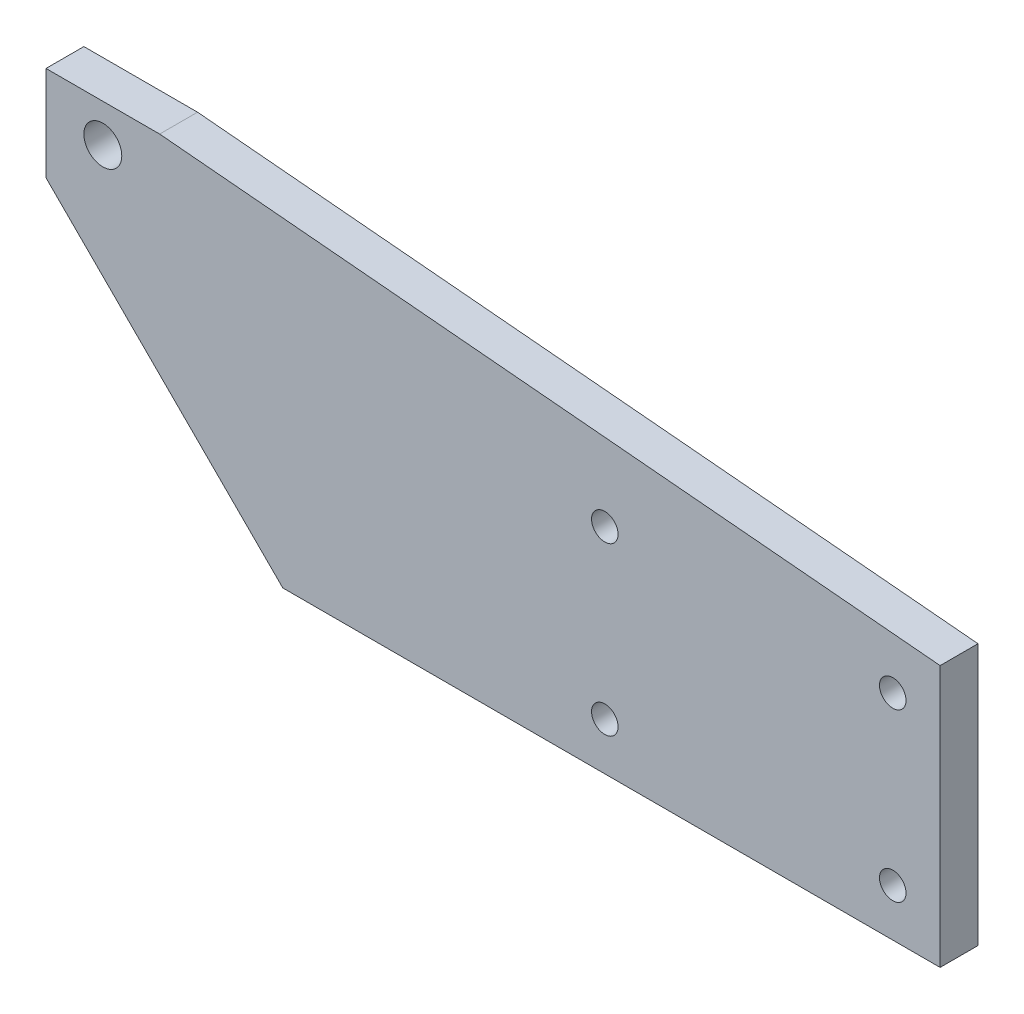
ISO-10303-21;
HEADER;
FILE_DESCRIPTION(('STEP AP214'),'2;1');
FILE_NAME('part.step','',(''),(''),'','','');
FILE_SCHEMA(('AUTOMOTIVE_DESIGN { 1 0 10303 214 1 1 1 1 }'));
ENDSEC;
DATA;
#1=APPLICATION_CONTEXT('core data for automotive mechanical design processes');
#2=APPLICATION_PROTOCOL_DEFINITION('international standard','automotive_design',2000,#1);
#3=PRODUCT_CONTEXT('',#1,'mechanical');
#4=PRODUCT('Part','Part','',(#3));
#5=PRODUCT_RELATED_PRODUCT_CATEGORY('part','',(#4));
#6=PRODUCT_DEFINITION_FORMATION('','',#4);
#7=PRODUCT_DEFINITION_CONTEXT('part definition',#1,'design');
#8=PRODUCT_DEFINITION('design','',#6,#7);
#9=PRODUCT_DEFINITION_SHAPE('','',#8);
#10=(LENGTH_UNIT() NAMED_UNIT(*) SI_UNIT(.MILLI.,.METRE.));
#11=(NAMED_UNIT(*) PLANE_ANGLE_UNIT() SI_UNIT($,.RADIAN.));
#12=(NAMED_UNIT(*) SI_UNIT($,.STERADIAN.) SOLID_ANGLE_UNIT());
#13=UNCERTAINTY_MEASURE_WITH_UNIT(LENGTH_MEASURE(1.E-05),#10,'distance_accuracy_value','');
#14=(GEOMETRIC_REPRESENTATION_CONTEXT(3) GLOBAL_UNCERTAINTY_ASSIGNED_CONTEXT((#13)) GLOBAL_UNIT_ASSIGNED_CONTEXT((#10,
#11,#12)) REPRESENTATION_CONTEXT('',''));
#15=CARTESIAN_POINT('',(0.,0.,0.));
#16=DIRECTION('',(0.,0.,1.));
#17=DIRECTION('',(1.,0.,0.));
#18=AXIS2_PLACEMENT_3D('',#15,#16,#17);
#19=CARTESIAN_POINT('',(472.,175.,0.));
#20=DIRECTION('',(0.,0.,1.));
#21=DIRECTION('',(1.,0.,0.));
#22=AXIS2_PLACEMENT_3D('',#19,#20,#21);
#23=PLANE('',#22);
#24=CARTESIAN_POINT('',(295.,25.,0.));
#25=DIRECTION('',(0.,0.,1.));
#26=DIRECTION('',(1.,0.,0.));
#27=AXIS2_PLACEMENT_3D('',#24,#25,#26);
#28=CIRCLE('',#27,6.99999999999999);
#29=CARTESIAN_POINT('',(302.,25.,0.));
#30=VERTEX_POINT('',#29);
#31=EDGE_CURVE('E195',#30,#30,#28,.T.);
#32=ORIENTED_EDGE('',*,*,#31,.T.);
#33=EDGE_LOOP('',(#32));
#34=FACE_BOUND('',#33,.T.);
#35=CARTESIAN_POINT('',(447.,25.,0.));
#36=DIRECTION('',(0.,0.,1.));
#37=DIRECTION('',(1.,0.,0.));
#38=AXIS2_PLACEMENT_3D('',#35,#36,#37);
#39=CIRCLE('',#38,6.99999999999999);
#40=CARTESIAN_POINT('',(454.,25.,0.));
#41=VERTEX_POINT('',#40);
#42=EDGE_CURVE('E208',#41,#41,#39,.T.);
#43=ORIENTED_EDGE('',*,*,#42,.T.);
#44=EDGE_LOOP('',(#43));
#45=FACE_BOUND('',#44,.T.);
#46=DIRECTION('',(-1.,0.,0.));
#47=VECTOR('',#46,1.);
#48=CARTESIAN_POINT('',(0.,175.,0.));
#49=LINE('',#48,#47);
#50=CARTESIAN_POINT('',(60.,175.,0.));
#51=VERTEX_POINT('',#50);
#52=CARTESIAN_POINT('',(0.,175.,0.));
#53=VERTEX_POINT('',#52);
#54=EDGE_CURVE('E87',#51,#53,#49,.T.);
#55=ORIENTED_EDGE('',*,*,#54,.F.);
#56=DIRECTION('',(-0.995991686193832,0.0894458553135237,0.));
#57=VECTOR('',#56,1.);
#58=CARTESIAN_POINT('',(472.,138.,0.));
#59=LINE('',#58,#57);
#60=CARTESIAN_POINT('',(472.,138.,0.));
#61=VERTEX_POINT('',#60);
#62=EDGE_CURVE('E113',#61,#51,#59,.T.);
#63=ORIENTED_EDGE('',*,*,#62,.F.);
#64=DIRECTION('',(0.,1.,0.));
#65=VECTOR('',#64,1.);
#66=CARTESIAN_POINT('',(472.,0.,0.));
#67=LINE('',#66,#65);
#68=CARTESIAN_POINT('',(472.,0.,0.));
#69=VERTEX_POINT('',#68);
#70=EDGE_CURVE('E111',#69,#61,#67,.T.);
#71=ORIENTED_EDGE('',*,*,#70,.F.);
#72=DIRECTION('',(1.,0.,0.));
#73=VECTOR('',#72,1.);
#74=CARTESIAN_POINT('',(125.,0.,0.));
#75=LINE('',#74,#73);
#76=CARTESIAN_POINT('',(125.,0.,0.));
#77=VERTEX_POINT('',#76);
#78=EDGE_CURVE('E109',#77,#69,#75,.T.);
#79=ORIENTED_EDGE('',*,*,#78,.F.);
#80=DIRECTION('',(0.707106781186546,-0.707106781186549,0.));
#81=VECTOR('',#80,1.);
#82=CARTESIAN_POINT('',(125.,0.,0.));
#83=LINE('',#82,#81);
#84=CARTESIAN_POINT('',(0.,125.,0.));
#85=VERTEX_POINT('',#84);
#86=EDGE_CURVE('E89',#85,#77,#83,.T.);
#87=ORIENTED_EDGE('',*,*,#86,.F.);
#88=DIRECTION('',(0.,-1.,0.));
#89=VECTOR('',#88,1.);
#90=CARTESIAN_POINT('',(0.,125.,0.));
#91=LINE('',#90,#89);
#92=EDGE_CURVE('E83',#53,#85,#91,.T.);
#93=ORIENTED_EDGE('',*,*,#92,.F.);
#94=EDGE_LOOP('',(#55,#63,#71,#79,#87,#93));
#95=FACE_BOUND('',#94,.T.);
#96=CARTESIAN_POINT('',(30.,155.,0.));
#97=DIRECTION('',(0.,0.,1.));
#98=DIRECTION('',(1.,0.,0.));
#99=AXIS2_PLACEMENT_3D('',#96,#97,#98);
#100=CIRCLE('',#99,10.);
#101=CARTESIAN_POINT('',(40.,155.,0.));
#102=VERTEX_POINT('',#101);
#103=EDGE_CURVE('E104',#102,#102,#100,.T.);
#104=ORIENTED_EDGE('',*,*,#103,.T.);
#105=EDGE_LOOP('',(#104));
#106=FACE_BOUND('',#105,.T.);
#107=CARTESIAN_POINT('',(447.,113.,0.));
#108=DIRECTION('',(0.,0.,1.));
#109=DIRECTION('',(1.,0.,0.));
#110=AXIS2_PLACEMENT_3D('',#107,#108,#109);
#111=CIRCLE('',#110,7.00000000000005);
#112=CARTESIAN_POINT('',(454.,113.,0.));
#113=VERTEX_POINT('',#112);
#114=EDGE_CURVE('E202',#113,#113,#111,.T.);
#115=ORIENTED_EDGE('',*,*,#114,.T.);
#116=EDGE_LOOP('',(#115));
#117=FACE_BOUND('',#116,.T.);
#118=CARTESIAN_POINT('',(295.,113.,0.));
#119=DIRECTION('',(0.,0.,1.));
#120=DIRECTION('',(1.,0.,0.));
#121=AXIS2_PLACEMENT_3D('',#118,#119,#120);
#122=CIRCLE('',#121,6.99999999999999);
#123=CARTESIAN_POINT('',(302.,113.,0.));
#124=VERTEX_POINT('',#123);
#125=EDGE_CURVE('E192',#124,#124,#122,.T.);
#126=ORIENTED_EDGE('',*,*,#125,.T.);
#127=EDGE_LOOP('',(#126));
#128=FACE_BOUND('',#127,.T.);
#129=ADVANCED_FACE('F30',(#34,#45,#95,#106,#117,#128),#23,.F.);
#130=CARTESIAN_POINT('',(472.,175.,20.));
#131=DIRECTION('',(0.,0.,1.));
#132=DIRECTION('',(1.,0.,0.));
#133=AXIS2_PLACEMENT_3D('',#130,#131,#132);
#134=PLANE('',#133);
#135=CARTESIAN_POINT('',(295.,25.,20.));
#136=DIRECTION('',(0.,0.,1.));
#137=DIRECTION('',(1.,0.,0.));
#138=AXIS2_PLACEMENT_3D('',#135,#136,#137);
#139=CIRCLE('',#138,6.99999999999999);
#140=CARTESIAN_POINT('',(302.,25.,20.));
#141=VERTEX_POINT('',#140);
#142=EDGE_CURVE('E199',#141,#141,#139,.T.);
#143=ORIENTED_EDGE('',*,*,#142,.F.);
#144=EDGE_LOOP('',(#143));
#145=FACE_BOUND('',#144,.T.);
#146=CARTESIAN_POINT('',(447.,25.,20.));
#147=DIRECTION('',(0.,0.,1.));
#148=DIRECTION('',(1.,0.,0.));
#149=AXIS2_PLACEMENT_3D('',#146,#147,#148);
#150=CIRCLE('',#149,6.99999999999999);
#151=CARTESIAN_POINT('',(454.,25.,20.));
#152=VERTEX_POINT('',#151);
#153=EDGE_CURVE('E211',#152,#152,#150,.T.);
#154=ORIENTED_EDGE('',*,*,#153,.F.);
#155=EDGE_LOOP('',(#154));
#156=FACE_BOUND('',#155,.T.);
#157=DIRECTION('',(-1.,0.,0.));
#158=VECTOR('',#157,1.);
#159=CARTESIAN_POINT('',(0.,175.,20.));
#160=LINE('',#159,#158);
#161=CARTESIAN_POINT('',(60.,175.,20.));
#162=VERTEX_POINT('',#161);
#163=CARTESIAN_POINT('',(0.,175.,20.));
#164=VERTEX_POINT('',#163);
#165=EDGE_CURVE('E115',#162,#164,#160,.T.);
#166=ORIENTED_EDGE('',*,*,#165,.T.);
#167=DIRECTION('',(0.,-1.,0.));
#168=VECTOR('',#167,1.);
#169=CARTESIAN_POINT('',(0.,125.,20.));
#170=LINE('',#169,#168);
#171=CARTESIAN_POINT('',(0.,125.,20.));
#172=VERTEX_POINT('',#171);
#173=EDGE_CURVE('E96',#164,#172,#170,.T.);
#174=ORIENTED_EDGE('',*,*,#173,.T.);
#175=DIRECTION('',(0.707106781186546,-0.707106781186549,0.));
#176=VECTOR('',#175,1.);
#177=CARTESIAN_POINT('',(125.,0.,20.));
#178=LINE('',#177,#176);
#179=CARTESIAN_POINT('',(125.,0.,20.));
#180=VERTEX_POINT('',#179);
#181=EDGE_CURVE('E118',#172,#180,#178,.T.);
#182=ORIENTED_EDGE('',*,*,#181,.T.);
#183=DIRECTION('',(1.,0.,0.));
#184=VECTOR('',#183,1.);
#185=CARTESIAN_POINT('',(125.,0.,20.));
#186=LINE('',#185,#184);
#187=CARTESIAN_POINT('',(472.,0.,20.));
#188=VERTEX_POINT('',#187);
#189=EDGE_CURVE('E120',#180,#188,#186,.T.);
#190=ORIENTED_EDGE('',*,*,#189,.T.);
#191=DIRECTION('',(0.,1.,0.));
#192=VECTOR('',#191,1.);
#193=CARTESIAN_POINT('',(472.,0.,20.));
#194=LINE('',#193,#192);
#195=CARTESIAN_POINT('',(472.,138.,20.));
#196=VERTEX_POINT('',#195);
#197=EDGE_CURVE('E50',#188,#196,#194,.T.);
#198=ORIENTED_EDGE('',*,*,#197,.T.);
#199=DIRECTION('',(-0.995991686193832,0.0894458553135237,0.));
#200=VECTOR('',#199,1.);
#201=CARTESIAN_POINT('',(472.,138.,20.));
#202=LINE('',#201,#200);
#203=EDGE_CURVE('E45',#196,#162,#202,.T.);
#204=ORIENTED_EDGE('',*,*,#203,.T.);
#205=EDGE_LOOP('',(#166,#174,#182,#190,#198,#204));
#206=FACE_BOUND('',#205,.T.);
#207=CARTESIAN_POINT('',(30.,155.,20.));
#208=DIRECTION('',(0.,0.,1.));
#209=DIRECTION('',(1.,0.,0.));
#210=AXIS2_PLACEMENT_3D('',#207,#208,#209);
#211=CIRCLE('',#210,10.);
#212=CARTESIAN_POINT('',(40.,155.,20.));
#213=VERTEX_POINT('',#212);
#214=EDGE_CURVE('E101',#213,#213,#211,.T.);
#215=ORIENTED_EDGE('',*,*,#214,.F.);
#216=EDGE_LOOP('',(#215));
#217=FACE_BOUND('',#216,.T.);
#218=CARTESIAN_POINT('',(447.,113.,20.));
#219=DIRECTION('',(0.,0.,1.));
#220=DIRECTION('',(1.,0.,0.));
#221=AXIS2_PLACEMENT_3D('',#218,#219,#220);
#222=CIRCLE('',#221,7.00000000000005);
#223=CARTESIAN_POINT('',(454.,113.,20.));
#224=VERTEX_POINT('',#223);
#225=EDGE_CURVE('E205',#224,#224,#222,.T.);
#226=ORIENTED_EDGE('',*,*,#225,.F.);
#227=EDGE_LOOP('',(#226));
#228=FACE_BOUND('',#227,.T.);
#229=CARTESIAN_POINT('',(295.,113.,20.));
#230=DIRECTION('',(0.,0.,1.));
#231=DIRECTION('',(1.,0.,0.));
#232=AXIS2_PLACEMENT_3D('',#229,#230,#231);
#233=CIRCLE('',#232,6.99999999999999);
#234=CARTESIAN_POINT('',(302.,113.,20.));
#235=VERTEX_POINT('',#234);
#236=EDGE_CURVE('E189',#235,#235,#233,.T.);
#237=ORIENTED_EDGE('',*,*,#236,.F.);
#238=EDGE_LOOP('',(#237));
#239=FACE_BOUND('',#238,.T.);
#240=ADVANCED_FACE('F138',(#145,#156,#206,#217,#228,#239),#134,.T.);
#241=CARTESIAN_POINT('',(0.,175.,20.));
#242=DIRECTION('',(0.,-1.,0.));
#243=DIRECTION('',(0.,0.,-1.));
#244=AXIS2_PLACEMENT_3D('',#241,#242,#243);
#245=PLANE('',#244);
#246=ORIENTED_EDGE('',*,*,#54,.T.);
#247=DIRECTION('',(0.,0.,-1.));
#248=VECTOR('',#247,1.);
#249=CARTESIAN_POINT('',(0.,175.,20.));
#250=LINE('',#249,#248);
#251=EDGE_CURVE('E11',#164,#53,#250,.T.);
#252=ORIENTED_EDGE('',*,*,#251,.F.);
#253=ORIENTED_EDGE('',*,*,#165,.F.);
#254=DIRECTION('',(0.,0.,-1.));
#255=VECTOR('',#254,1.);
#256=CARTESIAN_POINT('',(60.,175.,20.));
#257=LINE('',#256,#255);
#258=EDGE_CURVE('E100',#162,#51,#257,.T.);
#259=ORIENTED_EDGE('',*,*,#258,.T.);
#260=EDGE_LOOP('',(#246,#252,#253,#259));
#261=FACE_BOUND('',#260,.T.);
#262=ADVANCED_FACE('F32',(#261),#245,.F.);
#263=CARTESIAN_POINT('',(0.,125.,20.));
#264=DIRECTION('',(1.,0.,0.));
#265=DIRECTION('',(0.,0.,-1.));
#266=AXIS2_PLACEMENT_3D('',#263,#264,#265);
#267=PLANE('',#266);
#268=ORIENTED_EDGE('',*,*,#92,.T.);
#269=DIRECTION('',(0.,0.,-1.));
#270=VECTOR('',#269,1.);
#271=CARTESIAN_POINT('',(0.,125.,20.));
#272=LINE('',#271,#270);
#273=EDGE_CURVE('E38',#172,#85,#272,.T.);
#274=ORIENTED_EDGE('',*,*,#273,.F.);
#275=ORIENTED_EDGE('',*,*,#173,.F.);
#276=ORIENTED_EDGE('',*,*,#251,.T.);
#277=EDGE_LOOP('',(#268,#274,#275,#276));
#278=FACE_BOUND('',#277,.T.);
#279=ADVANCED_FACE('F95',(#278),#267,.F.);
#280=CARTESIAN_POINT('',(125.,0.,20.));
#281=DIRECTION('',(0.707106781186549,0.707106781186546,0.));
#282=DIRECTION('',(-0.707106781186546,0.707106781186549,0.));
#283=AXIS2_PLACEMENT_3D('',#280,#281,#282);
#284=PLANE('',#283);
#285=ORIENTED_EDGE('',*,*,#86,.T.);
#286=DIRECTION('',(0.,0.,-1.));
#287=VECTOR('',#286,1.);
#288=CARTESIAN_POINT('',(125.,0.,20.));
#289=LINE('',#288,#287);
#290=EDGE_CURVE('E131',#180,#77,#289,.T.);
#291=ORIENTED_EDGE('',*,*,#290,.F.);
#292=ORIENTED_EDGE('',*,*,#181,.F.);
#293=ORIENTED_EDGE('',*,*,#273,.T.);
#294=EDGE_LOOP('',(#285,#291,#292,#293));
#295=FACE_BOUND('',#294,.T.);
#296=ADVANCED_FACE('F135',(#295),#284,.F.);
#297=CARTESIAN_POINT('',(125.,0.,20.));
#298=DIRECTION('',(0.,1.,0.));
#299=DIRECTION('',(0.,0.,1.));
#300=AXIS2_PLACEMENT_3D('',#297,#298,#299);
#301=PLANE('',#300);
#302=ORIENTED_EDGE('',*,*,#78,.T.);
#303=DIRECTION('',(0.,0.,-1.));
#304=VECTOR('',#303,1.);
#305=CARTESIAN_POINT('',(472.,0.,20.));
#306=LINE('',#305,#304);
#307=EDGE_CURVE('E128',#188,#69,#306,.T.);
#308=ORIENTED_EDGE('',*,*,#307,.F.);
#309=ORIENTED_EDGE('',*,*,#189,.F.);
#310=ORIENTED_EDGE('',*,*,#290,.T.);
#311=EDGE_LOOP('',(#302,#308,#309,#310));
#312=FACE_BOUND('',#311,.T.);
#313=ADVANCED_FACE('F142',(#312),#301,.F.);
#314=CARTESIAN_POINT('',(472.,0.,20.));
#315=DIRECTION('',(-1.,0.,0.));
#316=DIRECTION('',(0.,0.,1.));
#317=AXIS2_PLACEMENT_3D('',#314,#315,#316);
#318=PLANE('',#317);
#319=ORIENTED_EDGE('',*,*,#70,.T.);
#320=DIRECTION('',(0.,0.,-1.));
#321=VECTOR('',#320,1.);
#322=CARTESIAN_POINT('',(472.,138.,20.));
#323=LINE('',#322,#321);
#324=EDGE_CURVE('E125',#196,#61,#323,.T.);
#325=ORIENTED_EDGE('',*,*,#324,.F.);
#326=ORIENTED_EDGE('',*,*,#197,.F.);
#327=ORIENTED_EDGE('',*,*,#307,.T.);
#328=EDGE_LOOP('',(#319,#325,#326,#327));
#329=FACE_BOUND('',#328,.T.);
#330=ADVANCED_FACE('F145',(#329),#318,.F.);
#331=CARTESIAN_POINT('',(472.,138.,20.));
#332=DIRECTION('',(-0.0894458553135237,-0.995991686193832,0.));
#333=DIRECTION('',(0.995991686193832,-0.0894458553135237,0.));
#334=AXIS2_PLACEMENT_3D('',#331,#332,#333);
#335=PLANE('',#334);
#336=ORIENTED_EDGE('',*,*,#62,.T.);
#337=ORIENTED_EDGE('',*,*,#258,.F.);
#338=ORIENTED_EDGE('',*,*,#203,.F.);
#339=ORIENTED_EDGE('',*,*,#324,.T.);
#340=EDGE_LOOP('',(#336,#337,#338,#339));
#341=FACE_BOUND('',#340,.T.);
#342=ADVANCED_FACE('F147',(#341),#335,.F.);
#343=CARTESIAN_POINT('',(30.,155.,20.));
#344=DIRECTION('',(0.,0.,-1.));
#345=DIRECTION('',(-1.,0.,0.));
#346=AXIS2_PLACEMENT_3D('',#343,#344,#345);
#347=CYLINDRICAL_SURFACE('',#346,10.);
#348=ORIENTED_EDGE('',*,*,#214,.T.);
#349=EDGE_LOOP('',(#348));
#350=FACE_BOUND('',#349,.T.);
#351=ORIENTED_EDGE('',*,*,#103,.F.);
#352=EDGE_LOOP('',(#351));
#353=FACE_BOUND('',#352,.T.);
#354=ADVANCED_FACE('F149',(#350,#353),#347,.F.);
#355=CARTESIAN_POINT('',(447.,25.,20.));
#356=DIRECTION('',(0.,0.,-1.));
#357=DIRECTION('',(-1.,0.,0.));
#358=AXIS2_PLACEMENT_3D('',#355,#356,#357);
#359=CYLINDRICAL_SURFACE('',#358,6.99999999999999);
#360=ORIENTED_EDGE('',*,*,#153,.T.);
#361=EDGE_LOOP('',(#360));
#362=FACE_BOUND('',#361,.T.);
#363=ORIENTED_EDGE('',*,*,#42,.F.);
#364=EDGE_LOOP('',(#363));
#365=FACE_BOUND('',#364,.T.);
#366=ADVANCED_FACE('F155',(#362,#365),#359,.F.);
#367=CARTESIAN_POINT('',(447.,113.,20.));
#368=DIRECTION('',(0.,0.,-1.));
#369=DIRECTION('',(-1.,0.,0.));
#370=AXIS2_PLACEMENT_3D('',#367,#368,#369);
#371=CYLINDRICAL_SURFACE('',#370,7.00000000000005);
#372=ORIENTED_EDGE('',*,*,#225,.T.);
#373=EDGE_LOOP('',(#372));
#374=FACE_BOUND('',#373,.T.);
#375=ORIENTED_EDGE('',*,*,#114,.F.);
#376=EDGE_LOOP('',(#375));
#377=FACE_BOUND('',#376,.T.);
#378=ADVANCED_FACE('F172',(#374,#377),#371,.F.);
#379=CARTESIAN_POINT('',(295.,25.,20.));
#380=DIRECTION('',(0.,0.,-1.));
#381=DIRECTION('',(-1.,0.,0.));
#382=AXIS2_PLACEMENT_3D('',#379,#380,#381);
#383=CYLINDRICAL_SURFACE('',#382,6.99999999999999);
#384=ORIENTED_EDGE('',*,*,#142,.T.);
#385=EDGE_LOOP('',(#384));
#386=FACE_BOUND('',#385,.T.);
#387=ORIENTED_EDGE('',*,*,#31,.F.);
#388=EDGE_LOOP('',(#387));
#389=FACE_BOUND('',#388,.T.);
#390=ADVANCED_FACE('F176',(#386,#389),#383,.F.);
#391=CARTESIAN_POINT('',(295.,113.,20.));
#392=DIRECTION('',(0.,0.,-1.));
#393=DIRECTION('',(-1.,0.,0.));
#394=AXIS2_PLACEMENT_3D('',#391,#392,#393);
#395=CYLINDRICAL_SURFACE('',#394,6.99999999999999);
#396=ORIENTED_EDGE('',*,*,#236,.T.);
#397=EDGE_LOOP('',(#396));
#398=FACE_BOUND('',#397,.T.);
#399=ORIENTED_EDGE('',*,*,#125,.F.);
#400=EDGE_LOOP('',(#399));
#401=FACE_BOUND('',#400,.T.);
#402=ADVANCED_FACE('F180',(#398,#401),#395,.F.);
#403=CLOSED_SHELL('',(#129,#240,#262,#279,#296,#313,#330,#342,#354,#366,#378,#390,#402));
#404=MANIFOLD_SOLID_BREP('B2',#403);
#405=ADVANCED_BREP_SHAPE_REPRESENTATION('',(#18,#404),#14);
#406=SHAPE_DEFINITION_REPRESENTATION(#9,#405);
ENDSEC;
END-ISO-10303-21;
